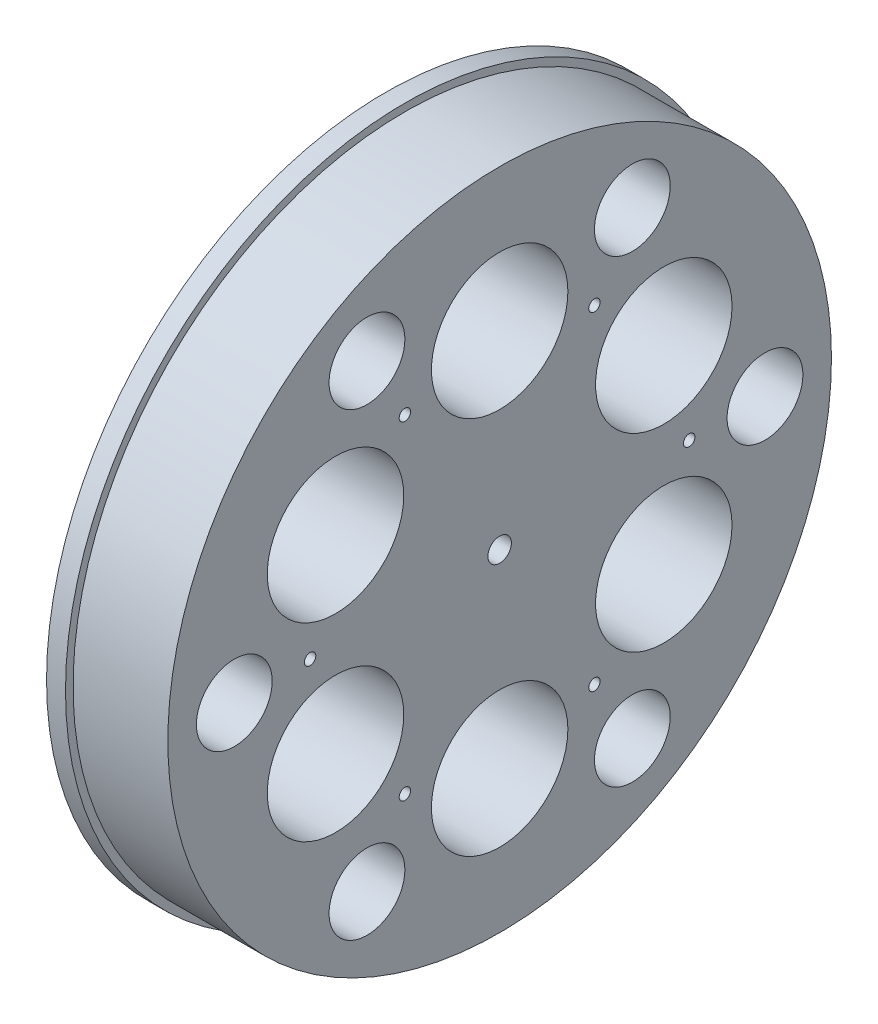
ISO-10303-21;
HEADER;
FILE_DESCRIPTION(('STEP AP214'),'2;1');
FILE_NAME('part.step','',(''),(''),'','','');
FILE_SCHEMA(('AUTOMOTIVE_DESIGN { 1 0 10303 214 1 1 1 1 }'));
ENDSEC;
DATA;
#1=APPLICATION_CONTEXT('core data for automotive mechanical design processes');
#2=APPLICATION_PROTOCOL_DEFINITION('international standard','automotive_design',2000,#1);
#3=PRODUCT_CONTEXT('',#1,'mechanical');
#4=PRODUCT('Part','Part','',(#3));
#5=PRODUCT_RELATED_PRODUCT_CATEGORY('part','',(#4));
#6=PRODUCT_DEFINITION_FORMATION('','',#4);
#7=PRODUCT_DEFINITION_CONTEXT('part definition',#1,'design');
#8=PRODUCT_DEFINITION('design','',#6,#7);
#9=PRODUCT_DEFINITION_SHAPE('','',#8);
#10=(LENGTH_UNIT() NAMED_UNIT(*) SI_UNIT(.MILLI.,.METRE.));
#11=(NAMED_UNIT(*) PLANE_ANGLE_UNIT() SI_UNIT($,.RADIAN.));
#12=(NAMED_UNIT(*) SI_UNIT($,.STERADIAN.) SOLID_ANGLE_UNIT());
#13=UNCERTAINTY_MEASURE_WITH_UNIT(LENGTH_MEASURE(1.E-05),#10,'distance_accuracy_value','');
#14=(GEOMETRIC_REPRESENTATION_CONTEXT(3) GLOBAL_UNCERTAINTY_ASSIGNED_CONTEXT((#13)) GLOBAL_UNIT_ASSIGNED_CONTEXT((#10,
#11,#12)) REPRESENTATION_CONTEXT('',''));
#15=CARTESIAN_POINT('',(0.,0.,0.));
#16=DIRECTION('',(0.,0.,1.));
#17=DIRECTION('',(1.,0.,0.));
#18=AXIS2_PLACEMENT_3D('',#15,#16,#17);
#19=CARTESIAN_POINT('',(30.,0.,-290.));
#20=DIRECTION('',(1.,0.,0.));
#21=DIRECTION('',(0.,0.,-1.));
#22=AXIS2_PLACEMENT_3D('',#19,#20,#21);
#23=PLANE('',#22);
#24=CARTESIAN_POINT('',(30.,0.,-290.));
#25=DIRECTION('',(1.,0.,0.));
#26=DIRECTION('',(0.,0.,-1.));
#27=AXIS2_PLACEMENT_3D('',#24,#25,#26);
#28=CIRCLE('',#27,3.09999999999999);
#29=CARTESIAN_POINT('',(30.,0.,-293.1));
#30=VERTEX_POINT('',#29);
#31=EDGE_CURVE('E152',#30,#30,#28,.T.);
#32=ORIENTED_EDGE('',*,*,#31,.F.);
#33=EDGE_LOOP('',(#32));
#34=FACE_BOUND('',#33,.T.);
#35=CARTESIAN_POINT('',(30.,-60.6217782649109,-324.999999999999));
#36=DIRECTION('',(1.,0.,0.));
#37=DIRECTION('',(0.,0.,-1.));
#38=AXIS2_PLACEMENT_3D('',#35,#36,#37);
#39=CIRCLE('',#38,10.);
#40=CARTESIAN_POINT('',(30.,-60.6217782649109,-334.999999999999));
#41=VERTEX_POINT('',#40);
#42=EDGE_CURVE('E140',#41,#41,#39,.T.);
#43=ORIENTED_EDGE('',*,*,#42,.F.);
#44=EDGE_LOOP('',(#43));
#45=FACE_BOUND('',#44,.T.);
#46=CARTESIAN_POINT('',(30.,60.6217782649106,-325.));
#47=DIRECTION('',(1.,0.,0.));
#48=DIRECTION('',(0.,0.,-1.));
#49=AXIS2_PLACEMENT_3D('',#46,#47,#48);
#50=CIRCLE('',#49,10.);
#51=CARTESIAN_POINT('',(30.,60.6217782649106,-335.));
#52=VERTEX_POINT('',#51);
#53=EDGE_CURVE('E128',#52,#52,#50,.T.);
#54=ORIENTED_EDGE('',*,*,#53,.F.);
#55=EDGE_LOOP('',(#54));
#56=FACE_BOUND('',#55,.T.);
#57=CARTESIAN_POINT('',(30.,-43.3012701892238,-264.999999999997));
#58=DIRECTION('',(1.,0.,0.));
#59=DIRECTION('',(0.,0.,-1.));
#60=AXIS2_PLACEMENT_3D('',#57,#58,#59);
#61=CIRCLE('',#60,1.50000000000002);
#62=CARTESIAN_POINT('',(30.,-43.3012701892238,-266.499999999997));
#63=VERTEX_POINT('',#62);
#64=EDGE_CURVE('E116',#63,#63,#61,.T.);
#65=ORIENTED_EDGE('',*,*,#64,.F.);
#66=EDGE_LOOP('',(#65));
#67=FACE_BOUND('',#66,.T.);
#68=CARTESIAN_POINT('',(30.,-43.3012701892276,-314.999999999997));
#69=DIRECTION('',(1.,0.,0.));
#70=DIRECTION('',(0.,0.,-1.));
#71=AXIS2_PLACEMENT_3D('',#68,#69,#70);
#72=CIRCLE('',#71,1.50000000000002);
#73=CARTESIAN_POINT('',(30.,-43.3012701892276,-316.499999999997));
#74=VERTEX_POINT('',#73);
#75=EDGE_CURVE('E104',#74,#74,#72,.T.);
#76=ORIENTED_EDGE('',*,*,#75,.F.);
#77=EDGE_LOOP('',(#76));
#78=FACE_BOUND('',#77,.T.);
#79=CARTESIAN_POINT('',(30.,-7.60502771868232E-12,-340.));
#80=DIRECTION('',(1.,0.,0.));
#81=DIRECTION('',(0.,0.,-1.));
#82=AXIS2_PLACEMENT_3D('',#79,#80,#81);
#83=CIRCLE('',#82,1.49999999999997);
#84=CARTESIAN_POINT('',(30.,-7.60502771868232E-12,-341.5));
#85=VERTEX_POINT('',#84);
#86=EDGE_CURVE('E92',#85,#85,#83,.T.);
#87=ORIENTED_EDGE('',*,*,#86,.F.);
#88=EDGE_LOOP('',(#87));
#89=FACE_BOUND('',#88,.T.);
#90=CARTESIAN_POINT('',(30.,0.,-220.));
#91=DIRECTION('',(1.,0.,0.));
#92=DIRECTION('',(0.,0.,-1.));
#93=AXIS2_PLACEMENT_3D('',#90,#91,#92);
#94=CIRCLE('',#93,10.);
#95=CARTESIAN_POINT('',(30.,0.,-230.));
#96=VERTEX_POINT('',#95);
#97=EDGE_CURVE('E80',#96,#96,#94,.T.);
#98=ORIENTED_EDGE('',*,*,#97,.F.);
#99=EDGE_LOOP('',(#98));
#100=FACE_BOUND('',#99,.T.);
#101=CARTESIAN_POINT('',(30.,-25.0000000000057,-333.301270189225));
#102=DIRECTION('',(1.,0.,0.));
#103=DIRECTION('',(0.,0.,-1.));
#104=AXIS2_PLACEMENT_3D('',#101,#102,#103);
#105=CIRCLE('',#104,18.);
#106=CARTESIAN_POINT('',(30.,-25.0000000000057,-351.301270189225));
#107=VERTEX_POINT('',#106);
#108=EDGE_CURVE('E68',#107,#107,#105,.T.);
#109=ORIENTED_EDGE('',*,*,#108,.F.);
#110=EDGE_LOOP('',(#109));
#111=FACE_BOUND('',#110,.T.);
#112=CARTESIAN_POINT('',(30.,24.9999999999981,-333.301270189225));
#113=DIRECTION('',(1.,0.,0.));
#114=DIRECTION('',(0.,0.,-1.));
#115=AXIS2_PLACEMENT_3D('',#112,#113,#114);
#116=CIRCLE('',#115,18.);
#117=CARTESIAN_POINT('',(30.,24.9999999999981,-351.301270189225));
#118=VERTEX_POINT('',#117);
#119=EDGE_CURVE('E56',#118,#118,#116,.T.);
#120=ORIENTED_EDGE('',*,*,#119,.F.);
#121=EDGE_LOOP('',(#120));
#122=FACE_BOUND('',#121,.T.);
#123=CARTESIAN_POINT('',(30.,50.,-290.));
#124=DIRECTION('',(1.,0.,0.));
#125=DIRECTION('',(0.,0.,-1.));
#126=AXIS2_PLACEMENT_3D('',#123,#124,#125);
#127=CIRCLE('',#126,18.);
#128=CARTESIAN_POINT('',(30.,50.,-308.));
#129=VERTEX_POINT('',#128);
#130=EDGE_CURVE('E43',#129,#129,#127,.T.);
#131=ORIENTED_EDGE('',*,*,#130,.F.);
#132=EDGE_LOOP('',(#131));
#133=FACE_BOUND('',#132,.T.);
#134=CARTESIAN_POINT('',(30.,0.,-240.));
#135=DIRECTION('',(1.,0.,0.));
#136=DIRECTION('',(0.,0.,-1.));
#137=AXIS2_PLACEMENT_3D('',#134,#135,#136);
#138=CIRCLE('',#137,1.5);
#139=CARTESIAN_POINT('',(30.,0.,-241.5));
#140=VERTEX_POINT('',#139);
#141=EDGE_CURVE('E51',#140,#140,#138,.T.);
#142=ORIENTED_EDGE('',*,*,#141,.F.);
#143=EDGE_LOOP('',(#142));
#144=FACE_BOUND('',#143,.T.);
#145=CARTESIAN_POINT('',(30.,43.30127018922,-265.000000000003));
#146=DIRECTION('',(1.,0.,0.));
#147=DIRECTION('',(0.,0.,-1.));
#148=AXIS2_PLACEMENT_3D('',#145,#146,#147);
#149=CIRCLE('',#148,1.50000000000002);
#150=CARTESIAN_POINT('',(30.,43.30127018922,-266.500000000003));
#151=VERTEX_POINT('',#150);
#152=EDGE_CURVE('E62',#151,#151,#149,.T.);
#153=ORIENTED_EDGE('',*,*,#152,.F.);
#154=EDGE_LOOP('',(#153));
#155=FACE_BOUND('',#154,.T.);
#156=CARTESIAN_POINT('',(30.,43.3012701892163,-315.000000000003));
#157=DIRECTION('',(1.,0.,0.));
#158=DIRECTION('',(0.,0.,-1.));
#159=AXIS2_PLACEMENT_3D('',#156,#157,#158);
#160=CIRCLE('',#159,1.50000000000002);
#161=CARTESIAN_POINT('',(30.,43.3012701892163,-316.500000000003));
#162=VERTEX_POINT('',#161);
#163=EDGE_CURVE('E74',#162,#162,#160,.T.);
#164=ORIENTED_EDGE('',*,*,#163,.F.);
#165=EDGE_LOOP('',(#164));
#166=FACE_BOUND('',#165,.T.);
#167=CARTESIAN_POINT('',(30.,-50.0000000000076,-290.));
#168=DIRECTION('',(1.,0.,0.));
#169=DIRECTION('',(0.,0.,-1.));
#170=AXIS2_PLACEMENT_3D('',#167,#168,#169);
#171=CIRCLE('',#170,18.);
#172=CARTESIAN_POINT('',(30.,-50.0000000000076,-308.));
#173=VERTEX_POINT('',#172);
#174=EDGE_CURVE('E86',#173,#173,#171,.T.);
#175=ORIENTED_EDGE('',*,*,#174,.F.);
#176=EDGE_LOOP('',(#175));
#177=FACE_BOUND('',#176,.T.);
#178=CARTESIAN_POINT('',(30.,-25.0000000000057,-246.698729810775));
#179=DIRECTION('',(1.,0.,0.));
#180=DIRECTION('',(0.,0.,-1.));
#181=AXIS2_PLACEMENT_3D('',#178,#179,#180);
#182=CIRCLE('',#181,18.);
#183=CARTESIAN_POINT('',(30.,-25.0000000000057,-264.698729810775));
#184=VERTEX_POINT('',#183);
#185=EDGE_CURVE('E98',#184,#184,#182,.T.);
#186=ORIENTED_EDGE('',*,*,#185,.F.);
#187=EDGE_LOOP('',(#186));
#188=FACE_BOUND('',#187,.T.);
#189=CARTESIAN_POINT('',(30.,24.9999999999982,-246.698729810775));
#190=DIRECTION('',(1.,0.,0.));
#191=DIRECTION('',(0.,0.,-1.));
#192=AXIS2_PLACEMENT_3D('',#189,#190,#191);
#193=CIRCLE('',#192,18.);
#194=CARTESIAN_POINT('',(30.,24.9999999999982,-264.698729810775));
#195=VERTEX_POINT('',#194);
#196=EDGE_CURVE('E110',#195,#195,#193,.T.);
#197=ORIENTED_EDGE('',*,*,#196,.F.);
#198=EDGE_LOOP('',(#197));
#199=FACE_BOUND('',#198,.T.);
#200=CARTESIAN_POINT('',(30.,60.6217782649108,-255.));
#201=DIRECTION('',(1.,0.,0.));
#202=DIRECTION('',(0.,0.,-1.));
#203=AXIS2_PLACEMENT_3D('',#200,#201,#202);
#204=CIRCLE('',#203,10.);
#205=CARTESIAN_POINT('',(30.,60.6217782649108,-265.));
#206=VERTEX_POINT('',#205);
#207=EDGE_CURVE('E122',#206,#206,#204,.T.);
#208=ORIENTED_EDGE('',*,*,#207,.F.);
#209=EDGE_LOOP('',(#208));
#210=FACE_BOUND('',#209,.T.);
#211=CARTESIAN_POINT('',(30.,-4.88807670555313E-13,-360.));
#212=DIRECTION('',(1.,0.,0.));
#213=DIRECTION('',(0.,0.,-1.));
#214=AXIS2_PLACEMENT_3D('',#211,#212,#213);
#215=CIRCLE('',#214,10.0000000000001);
#216=CARTESIAN_POINT('',(30.,-4.88807670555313E-13,-370.));
#217=VERTEX_POINT('',#216);
#218=EDGE_CURVE('E134',#217,#217,#215,.T.);
#219=ORIENTED_EDGE('',*,*,#218,.F.);
#220=EDGE_LOOP('',(#219));
#221=FACE_BOUND('',#220,.T.);
#222=CARTESIAN_POINT('',(30.,-60.6217782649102,-254.999999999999));
#223=DIRECTION('',(1.,0.,0.));
#224=DIRECTION('',(0.,0.,-1.));
#225=AXIS2_PLACEMENT_3D('',#222,#223,#224);
#226=CIRCLE('',#225,9.99999999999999);
#227=CARTESIAN_POINT('',(30.,-60.6217782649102,-264.999999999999));
#228=VERTEX_POINT('',#227);
#229=EDGE_CURVE('E146',#228,#228,#226,.T.);
#230=ORIENTED_EDGE('',*,*,#229,.F.);
#231=EDGE_LOOP('',(#230));
#232=FACE_BOUND('',#231,.T.);
#233=CARTESIAN_POINT('',(30.,0.,-290.));
#234=DIRECTION('',(1.,0.,0.));
#235=DIRECTION('',(0.,0.,-1.));
#236=AXIS2_PLACEMENT_3D('',#233,#234,#235);
#237=CIRCLE('',#236,87.535);
#238=CARTESIAN_POINT('',(30.,0.,-377.535));
#239=VERTEX_POINT('',#238);
#240=EDGE_CURVE('E160',#239,#239,#237,.T.);
#241=ORIENTED_EDGE('',*,*,#240,.T.);
#242=EDGE_LOOP('',(#241));
#243=FACE_BOUND('',#242,.T.);
#244=ADVANCED_FACE('F35',(#34,#45,#56,#67,#78,#89,#100,#111,#122,#133,#144,#155,#166,#177,#188,
#199,#210,#221,#232,#243),#23,.T.);
#245=CARTESIAN_POINT('',(30.,0.,-290.));
#246=DIRECTION('',(-1.,0.,0.));
#247=DIRECTION('',(0.,0.,1.));
#248=AXIS2_PLACEMENT_3D('',#245,#246,#247);
#249=CYLINDRICAL_SURFACE('',#248,89.535);
#250=CARTESIAN_POINT('',(0.,0.,-290.));
#251=DIRECTION('',(1.,0.,0.));
#252=DIRECTION('',(0.,0.,-1.));
#253=AXIS2_PLACEMENT_3D('',#250,#251,#252);
#254=CIRCLE('',#253,89.535);
#255=CARTESIAN_POINT('',(0.,0.,-379.535));
#256=VERTEX_POINT('',#255);
#257=EDGE_CURVE('E10',#256,#256,#254,.T.);
#258=ORIENTED_EDGE('',*,*,#257,.T.);
#259=EDGE_LOOP('',(#258));
#260=FACE_BOUND('',#259,.T.);
#261=CARTESIAN_POINT('',(5.,0.,-290.));
#262=DIRECTION('',(1.,0.,0.));
#263=DIRECTION('',(0.,0.,-1.));
#264=AXIS2_PLACEMENT_3D('',#261,#262,#263);
#265=CIRCLE('',#264,89.535);
#266=CARTESIAN_POINT('',(5.,0.,-379.535));
#267=VERTEX_POINT('',#266);
#268=EDGE_CURVE('E39',#267,#267,#265,.T.);
#269=ORIENTED_EDGE('',*,*,#268,.F.);
#270=EDGE_LOOP('',(#269));
#271=FACE_BOUND('',#270,.T.);
#272=ADVANCED_FACE('F37',(#260,#271),#249,.T.);
#273=CARTESIAN_POINT('',(0.,0.,-290.));
#274=DIRECTION('',(1.,0.,0.));
#275=DIRECTION('',(0.,0.,-1.));
#276=AXIS2_PLACEMENT_3D('',#273,#274,#275);
#277=PLANE('',#276);
#278=CARTESIAN_POINT('',(0.,-60.6217782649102,-254.999999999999));
#279=DIRECTION('',(1.,0.,0.));
#280=DIRECTION('',(0.,0.,-1.));
#281=AXIS2_PLACEMENT_3D('',#278,#279,#280);
#282=CIRCLE('',#281,9.99999999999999);
#283=CARTESIAN_POINT('',(0.,-60.6217782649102,-264.999999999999));
#284=VERTEX_POINT('',#283);
#285=EDGE_CURVE('E149',#284,#284,#282,.T.);
#286=ORIENTED_EDGE('',*,*,#285,.T.);
#287=EDGE_LOOP('',(#286));
#288=FACE_BOUND('',#287,.T.);
#289=CARTESIAN_POINT('',(0.,-4.88807670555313E-13,-360.));
#290=DIRECTION('',(1.,0.,0.));
#291=DIRECTION('',(0.,0.,-1.));
#292=AXIS2_PLACEMENT_3D('',#289,#290,#291);
#293=CIRCLE('',#292,10.0000000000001);
#294=CARTESIAN_POINT('',(0.,-4.88807670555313E-13,-370.));
#295=VERTEX_POINT('',#294);
#296=EDGE_CURVE('E137',#295,#295,#293,.T.);
#297=ORIENTED_EDGE('',*,*,#296,.T.);
#298=EDGE_LOOP('',(#297));
#299=FACE_BOUND('',#298,.T.);
#300=CARTESIAN_POINT('',(0.,60.6217782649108,-255.));
#301=DIRECTION('',(1.,0.,0.));
#302=DIRECTION('',(0.,0.,-1.));
#303=AXIS2_PLACEMENT_3D('',#300,#301,#302);
#304=CIRCLE('',#303,10.);
#305=CARTESIAN_POINT('',(0.,60.6217782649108,-265.));
#306=VERTEX_POINT('',#305);
#307=EDGE_CURVE('E125',#306,#306,#304,.T.);
#308=ORIENTED_EDGE('',*,*,#307,.T.);
#309=EDGE_LOOP('',(#308));
#310=FACE_BOUND('',#309,.T.);
#311=CARTESIAN_POINT('',(0.,24.9999999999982,-246.698729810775));
#312=DIRECTION('',(1.,0.,0.));
#313=DIRECTION('',(0.,0.,-1.));
#314=AXIS2_PLACEMENT_3D('',#311,#312,#313);
#315=CIRCLE('',#314,18.);
#316=CARTESIAN_POINT('',(0.,24.9999999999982,-264.698729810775));
#317=VERTEX_POINT('',#316);
#318=EDGE_CURVE('E113',#317,#317,#315,.T.);
#319=ORIENTED_EDGE('',*,*,#318,.T.);
#320=EDGE_LOOP('',(#319));
#321=FACE_BOUND('',#320,.T.);
#322=CARTESIAN_POINT('',(0.,-25.0000000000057,-246.698729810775));
#323=DIRECTION('',(1.,0.,0.));
#324=DIRECTION('',(0.,0.,-1.));
#325=AXIS2_PLACEMENT_3D('',#322,#323,#324);
#326=CIRCLE('',#325,18.);
#327=CARTESIAN_POINT('',(0.,-25.0000000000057,-264.698729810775));
#328=VERTEX_POINT('',#327);
#329=EDGE_CURVE('E101',#328,#328,#326,.T.);
#330=ORIENTED_EDGE('',*,*,#329,.T.);
#331=EDGE_LOOP('',(#330));
#332=FACE_BOUND('',#331,.T.);
#333=CARTESIAN_POINT('',(0.,-50.0000000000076,-290.));
#334=DIRECTION('',(1.,0.,0.));
#335=DIRECTION('',(0.,0.,-1.));
#336=AXIS2_PLACEMENT_3D('',#333,#334,#335);
#337=CIRCLE('',#336,18.);
#338=CARTESIAN_POINT('',(0.,-50.0000000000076,-308.));
#339=VERTEX_POINT('',#338);
#340=EDGE_CURVE('E89',#339,#339,#337,.T.);
#341=ORIENTED_EDGE('',*,*,#340,.T.);
#342=EDGE_LOOP('',(#341));
#343=FACE_BOUND('',#342,.T.);
#344=CARTESIAN_POINT('',(0.,43.3012701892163,-315.000000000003));
#345=DIRECTION('',(1.,0.,0.));
#346=DIRECTION('',(0.,0.,-1.));
#347=AXIS2_PLACEMENT_3D('',#344,#345,#346);
#348=CIRCLE('',#347,1.50000000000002);
#349=CARTESIAN_POINT('',(0.,43.3012701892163,-316.500000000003));
#350=VERTEX_POINT('',#349);
#351=EDGE_CURVE('E77',#350,#350,#348,.T.);
#352=ORIENTED_EDGE('',*,*,#351,.T.);
#353=EDGE_LOOP('',(#352));
#354=FACE_BOUND('',#353,.T.);
#355=CARTESIAN_POINT('',(0.,43.30127018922,-265.000000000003));
#356=DIRECTION('',(1.,0.,0.));
#357=DIRECTION('',(0.,0.,-1.));
#358=AXIS2_PLACEMENT_3D('',#355,#356,#357);
#359=CIRCLE('',#358,1.50000000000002);
#360=CARTESIAN_POINT('',(0.,43.30127018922,-266.500000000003));
#361=VERTEX_POINT('',#360);
#362=EDGE_CURVE('E65',#361,#361,#359,.T.);
#363=ORIENTED_EDGE('',*,*,#362,.T.);
#364=EDGE_LOOP('',(#363));
#365=FACE_BOUND('',#364,.T.);
#366=CARTESIAN_POINT('',(0.,0.,-240.));
#367=DIRECTION('',(1.,0.,0.));
#368=DIRECTION('',(0.,0.,-1.));
#369=AXIS2_PLACEMENT_3D('',#366,#367,#368);
#370=CIRCLE('',#369,1.5);
#371=CARTESIAN_POINT('',(0.,0.,-241.5));
#372=VERTEX_POINT('',#371);
#373=EDGE_CURVE('E53',#372,#372,#370,.T.);
#374=ORIENTED_EDGE('',*,*,#373,.T.);
#375=EDGE_LOOP('',(#374));
#376=FACE_BOUND('',#375,.T.);
#377=ORIENTED_EDGE('',*,*,#257,.F.);
#378=EDGE_LOOP('',(#377));
#379=FACE_BOUND('',#378,.T.);
#380=CARTESIAN_POINT('',(0.,50.,-290.));
#381=DIRECTION('',(1.,0.,0.));
#382=DIRECTION('',(0.,0.,-1.));
#383=AXIS2_PLACEMENT_3D('',#380,#381,#382);
#384=CIRCLE('',#383,18.);
#385=CARTESIAN_POINT('',(0.,50.,-308.));
#386=VERTEX_POINT('',#385);
#387=EDGE_CURVE('E47',#386,#386,#384,.T.);
#388=ORIENTED_EDGE('',*,*,#387,.T.);
#389=EDGE_LOOP('',(#388));
#390=FACE_BOUND('',#389,.T.);
#391=CARTESIAN_POINT('',(0.,24.9999999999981,-333.301270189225));
#392=DIRECTION('',(1.,0.,0.));
#393=DIRECTION('',(0.,0.,-1.));
#394=AXIS2_PLACEMENT_3D('',#391,#392,#393);
#395=CIRCLE('',#394,18.);
#396=CARTESIAN_POINT('',(0.,24.9999999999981,-351.301270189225));
#397=VERTEX_POINT('',#396);
#398=EDGE_CURVE('E59',#397,#397,#395,.T.);
#399=ORIENTED_EDGE('',*,*,#398,.T.);
#400=EDGE_LOOP('',(#399));
#401=FACE_BOUND('',#400,.T.);
#402=CARTESIAN_POINT('',(0.,-25.0000000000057,-333.301270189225));
#403=DIRECTION('',(1.,0.,0.));
#404=DIRECTION('',(0.,0.,-1.));
#405=AXIS2_PLACEMENT_3D('',#402,#403,#404);
#406=CIRCLE('',#405,18.);
#407=CARTESIAN_POINT('',(0.,-25.0000000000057,-351.301270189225));
#408=VERTEX_POINT('',#407);
#409=EDGE_CURVE('E71',#408,#408,#406,.T.);
#410=ORIENTED_EDGE('',*,*,#409,.T.);
#411=EDGE_LOOP('',(#410));
#412=FACE_BOUND('',#411,.T.);
#413=CARTESIAN_POINT('',(0.,0.,-220.));
#414=DIRECTION('',(1.,0.,0.));
#415=DIRECTION('',(0.,0.,-1.));
#416=AXIS2_PLACEMENT_3D('',#413,#414,#415);
#417=CIRCLE('',#416,10.);
#418=CARTESIAN_POINT('',(0.,0.,-230.));
#419=VERTEX_POINT('',#418);
#420=EDGE_CURVE('E83',#419,#419,#417,.T.);
#421=ORIENTED_EDGE('',*,*,#420,.T.);
#422=EDGE_LOOP('',(#421));
#423=FACE_BOUND('',#422,.T.);
#424=CARTESIAN_POINT('',(0.,-7.60502771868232E-12,-340.));
#425=DIRECTION('',(1.,0.,0.));
#426=DIRECTION('',(0.,0.,-1.));
#427=AXIS2_PLACEMENT_3D('',#424,#425,#426);
#428=CIRCLE('',#427,1.49999999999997);
#429=CARTESIAN_POINT('',(0.,-7.60502771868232E-12,-341.5));
#430=VERTEX_POINT('',#429);
#431=EDGE_CURVE('E95',#430,#430,#428,.T.);
#432=ORIENTED_EDGE('',*,*,#431,.T.);
#433=EDGE_LOOP('',(#432));
#434=FACE_BOUND('',#433,.T.);
#435=CARTESIAN_POINT('',(0.,-43.3012701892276,-314.999999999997));
#436=DIRECTION('',(1.,0.,0.));
#437=DIRECTION('',(0.,0.,-1.));
#438=AXIS2_PLACEMENT_3D('',#435,#436,#437);
#439=CIRCLE('',#438,1.50000000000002);
#440=CARTESIAN_POINT('',(0.,-43.3012701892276,-316.499999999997));
#441=VERTEX_POINT('',#440);
#442=EDGE_CURVE('E107',#441,#441,#439,.T.);
#443=ORIENTED_EDGE('',*,*,#442,.T.);
#444=EDGE_LOOP('',(#443));
#445=FACE_BOUND('',#444,.T.);
#446=CARTESIAN_POINT('',(0.,-43.3012701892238,-264.999999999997));
#447=DIRECTION('',(1.,0.,0.));
#448=DIRECTION('',(0.,0.,-1.));
#449=AXIS2_PLACEMENT_3D('',#446,#447,#448);
#450=CIRCLE('',#449,1.50000000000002);
#451=CARTESIAN_POINT('',(0.,-43.3012701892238,-266.499999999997));
#452=VERTEX_POINT('',#451);
#453=EDGE_CURVE('E119',#452,#452,#450,.T.);
#454=ORIENTED_EDGE('',*,*,#453,.T.);
#455=EDGE_LOOP('',(#454));
#456=FACE_BOUND('',#455,.T.);
#457=CARTESIAN_POINT('',(0.,60.6217782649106,-325.));
#458=DIRECTION('',(1.,0.,0.));
#459=DIRECTION('',(0.,0.,-1.));
#460=AXIS2_PLACEMENT_3D('',#457,#458,#459);
#461=CIRCLE('',#460,10.);
#462=CARTESIAN_POINT('',(0.,60.6217782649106,-335.));
#463=VERTEX_POINT('',#462);
#464=EDGE_CURVE('E131',#463,#463,#461,.T.);
#465=ORIENTED_EDGE('',*,*,#464,.T.);
#466=EDGE_LOOP('',(#465));
#467=FACE_BOUND('',#466,.T.);
#468=CARTESIAN_POINT('',(0.,-60.6217782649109,-324.999999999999));
#469=DIRECTION('',(1.,0.,0.));
#470=DIRECTION('',(0.,0.,-1.));
#471=AXIS2_PLACEMENT_3D('',#468,#469,#470);
#472=CIRCLE('',#471,10.);
#473=CARTESIAN_POINT('',(0.,-60.6217782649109,-334.999999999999));
#474=VERTEX_POINT('',#473);
#475=EDGE_CURVE('E143',#474,#474,#472,.T.);
#476=ORIENTED_EDGE('',*,*,#475,.T.);
#477=EDGE_LOOP('',(#476));
#478=FACE_BOUND('',#477,.T.);
#479=CARTESIAN_POINT('',(0.,0.,-290.));
#480=DIRECTION('',(1.,0.,0.));
#481=DIRECTION('',(0.,0.,-1.));
#482=AXIS2_PLACEMENT_3D('',#479,#480,#481);
#483=CIRCLE('',#482,3.09999999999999);
#484=CARTESIAN_POINT('',(0.,0.,-293.1));
#485=VERTEX_POINT('',#484);
#486=EDGE_CURVE('E155',#485,#485,#483,.T.);
#487=ORIENTED_EDGE('',*,*,#486,.T.);
#488=EDGE_LOOP('',(#487));
#489=FACE_BOUND('',#488,.T.);
#490=ADVANCED_FACE('F173',(#288,#299,#310,#321,#332,#343,#354,#365,#376,#379,#390,#401,#412,
#423,#434,#445,#456,#467,#478,#489),#277,.F.);
#491=CARTESIAN_POINT('',(30.,50.,-290.));
#492=DIRECTION('',(-1.,0.,0.));
#493=DIRECTION('',(0.,0.,1.));
#494=AXIS2_PLACEMENT_3D('',#491,#492,#493);
#495=CYLINDRICAL_SURFACE('',#494,18.);
#496=ORIENTED_EDGE('',*,*,#130,.T.);
#497=EDGE_LOOP('',(#496));
#498=FACE_BOUND('',#497,.T.);
#499=ORIENTED_EDGE('',*,*,#387,.F.);
#500=EDGE_LOOP('',(#499));
#501=FACE_BOUND('',#500,.T.);
#502=ADVANCED_FACE('F178',(#498,#501),#495,.F.);
#503=CARTESIAN_POINT('',(30.,0.,-240.));
#504=DIRECTION('',(-1.,0.,0.));
#505=DIRECTION('',(0.,0.,1.));
#506=AXIS2_PLACEMENT_3D('',#503,#504,#505);
#507=CYLINDRICAL_SURFACE('',#506,1.5);
#508=ORIENTED_EDGE('',*,*,#141,.T.);
#509=EDGE_LOOP('',(#508));
#510=FACE_BOUND('',#509,.T.);
#511=ORIENTED_EDGE('',*,*,#373,.F.);
#512=EDGE_LOOP('',(#511));
#513=FACE_BOUND('',#512,.T.);
#514=ADVANCED_FACE('F189',(#510,#513),#507,.F.);
#515=CARTESIAN_POINT('',(30.,24.9999999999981,-333.301270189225));
#516=DIRECTION('',(-1.,0.,0.));
#517=DIRECTION('',(0.,0.,1.));
#518=AXIS2_PLACEMENT_3D('',#515,#516,#517);
#519=CYLINDRICAL_SURFACE('',#518,18.);
#520=ORIENTED_EDGE('',*,*,#119,.T.);
#521=EDGE_LOOP('',(#520));
#522=FACE_BOUND('',#521,.T.);
#523=ORIENTED_EDGE('',*,*,#398,.F.);
#524=EDGE_LOOP('',(#523));
#525=FACE_BOUND('',#524,.T.);
#526=ADVANCED_FACE('F193',(#522,#525),#519,.F.);
#527=CARTESIAN_POINT('',(30.,43.30127018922,-265.000000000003));
#528=DIRECTION('',(-1.,0.,0.));
#529=DIRECTION('',(0.,0.,1.));
#530=AXIS2_PLACEMENT_3D('',#527,#528,#529);
#531=CYLINDRICAL_SURFACE('',#530,1.50000000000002);
#532=ORIENTED_EDGE('',*,*,#152,.T.);
#533=EDGE_LOOP('',(#532));
#534=FACE_BOUND('',#533,.T.);
#535=ORIENTED_EDGE('',*,*,#362,.F.);
#536=EDGE_LOOP('',(#535));
#537=FACE_BOUND('',#536,.T.);
#538=ADVANCED_FACE('F197',(#534,#537),#531,.F.);
#539=CARTESIAN_POINT('',(30.,-25.0000000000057,-333.301270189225));
#540=DIRECTION('',(-1.,0.,0.));
#541=DIRECTION('',(0.,0.,1.));
#542=AXIS2_PLACEMENT_3D('',#539,#540,#541);
#543=CYLINDRICAL_SURFACE('',#542,18.);
#544=ORIENTED_EDGE('',*,*,#108,.T.);
#545=EDGE_LOOP('',(#544));
#546=FACE_BOUND('',#545,.T.);
#547=ORIENTED_EDGE('',*,*,#409,.F.);
#548=EDGE_LOOP('',(#547));
#549=FACE_BOUND('',#548,.T.);
#550=ADVANCED_FACE('F201',(#546,#549),#543,.F.);
#551=CARTESIAN_POINT('',(30.,43.3012701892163,-315.000000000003));
#552=DIRECTION('',(-1.,0.,0.));
#553=DIRECTION('',(0.,0.,1.));
#554=AXIS2_PLACEMENT_3D('',#551,#552,#553);
#555=CYLINDRICAL_SURFACE('',#554,1.50000000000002);
#556=ORIENTED_EDGE('',*,*,#163,.T.);
#557=EDGE_LOOP('',(#556));
#558=FACE_BOUND('',#557,.T.);
#559=ORIENTED_EDGE('',*,*,#351,.F.);
#560=EDGE_LOOP('',(#559));
#561=FACE_BOUND('',#560,.T.);
#562=ADVANCED_FACE('F205',(#558,#561),#555,.F.);
#563=CARTESIAN_POINT('',(30.,0.,-220.));
#564=DIRECTION('',(-1.,0.,0.));
#565=DIRECTION('',(0.,0.,1.));
#566=AXIS2_PLACEMENT_3D('',#563,#564,#565);
#567=CYLINDRICAL_SURFACE('',#566,10.);
#568=ORIENTED_EDGE('',*,*,#97,.T.);
#569=EDGE_LOOP('',(#568));
#570=FACE_BOUND('',#569,.T.);
#571=ORIENTED_EDGE('',*,*,#420,.F.);
#572=EDGE_LOOP('',(#571));
#573=FACE_BOUND('',#572,.T.);
#574=ADVANCED_FACE('F209',(#570,#573),#567,.F.);
#575=CARTESIAN_POINT('',(30.,-50.0000000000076,-290.));
#576=DIRECTION('',(-1.,0.,0.));
#577=DIRECTION('',(0.,0.,1.));
#578=AXIS2_PLACEMENT_3D('',#575,#576,#577);
#579=CYLINDRICAL_SURFACE('',#578,18.);
#580=ORIENTED_EDGE('',*,*,#174,.T.);
#581=EDGE_LOOP('',(#580));
#582=FACE_BOUND('',#581,.T.);
#583=ORIENTED_EDGE('',*,*,#340,.F.);
#584=EDGE_LOOP('',(#583));
#585=FACE_BOUND('',#584,.T.);
#586=ADVANCED_FACE('F213',(#582,#585),#579,.F.);
#587=CARTESIAN_POINT('',(30.,-7.60502771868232E-12,-340.));
#588=DIRECTION('',(-1.,0.,0.));
#589=DIRECTION('',(0.,0.,1.));
#590=AXIS2_PLACEMENT_3D('',#587,#588,#589);
#591=CYLINDRICAL_SURFACE('',#590,1.49999999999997);
#592=ORIENTED_EDGE('',*,*,#86,.T.);
#593=EDGE_LOOP('',(#592));
#594=FACE_BOUND('',#593,.T.);
#595=ORIENTED_EDGE('',*,*,#431,.F.);
#596=EDGE_LOOP('',(#595));
#597=FACE_BOUND('',#596,.T.);
#598=ADVANCED_FACE('F217',(#594,#597),#591,.F.);
#599=CARTESIAN_POINT('',(30.,-25.0000000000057,-246.698729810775));
#600=DIRECTION('',(-1.,0.,0.));
#601=DIRECTION('',(0.,0.,1.));
#602=AXIS2_PLACEMENT_3D('',#599,#600,#601);
#603=CYLINDRICAL_SURFACE('',#602,18.);
#604=ORIENTED_EDGE('',*,*,#185,.T.);
#605=EDGE_LOOP('',(#604));
#606=FACE_BOUND('',#605,.T.);
#607=ORIENTED_EDGE('',*,*,#329,.F.);
#608=EDGE_LOOP('',(#607));
#609=FACE_BOUND('',#608,.T.);
#610=ADVANCED_FACE('F221',(#606,#609),#603,.F.);
#611=CARTESIAN_POINT('',(30.,-43.3012701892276,-314.999999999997));
#612=DIRECTION('',(-1.,0.,0.));
#613=DIRECTION('',(0.,0.,1.));
#614=AXIS2_PLACEMENT_3D('',#611,#612,#613);
#615=CYLINDRICAL_SURFACE('',#614,1.50000000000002);
#616=ORIENTED_EDGE('',*,*,#75,.T.);
#617=EDGE_LOOP('',(#616));
#618=FACE_BOUND('',#617,.T.);
#619=ORIENTED_EDGE('',*,*,#442,.F.);
#620=EDGE_LOOP('',(#619));
#621=FACE_BOUND('',#620,.T.);
#622=ADVANCED_FACE('F225',(#618,#621),#615,.F.);
#623=CARTESIAN_POINT('',(30.,24.9999999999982,-246.698729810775));
#624=DIRECTION('',(-1.,0.,0.));
#625=DIRECTION('',(0.,0.,1.));
#626=AXIS2_PLACEMENT_3D('',#623,#624,#625);
#627=CYLINDRICAL_SURFACE('',#626,18.);
#628=ORIENTED_EDGE('',*,*,#196,.T.);
#629=EDGE_LOOP('',(#628));
#630=FACE_BOUND('',#629,.T.);
#631=ORIENTED_EDGE('',*,*,#318,.F.);
#632=EDGE_LOOP('',(#631));
#633=FACE_BOUND('',#632,.T.);
#634=ADVANCED_FACE('F229',(#630,#633),#627,.F.);
#635=CARTESIAN_POINT('',(30.,-43.3012701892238,-264.999999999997));
#636=DIRECTION('',(-1.,0.,0.));
#637=DIRECTION('',(0.,0.,1.));
#638=AXIS2_PLACEMENT_3D('',#635,#636,#637);
#639=CYLINDRICAL_SURFACE('',#638,1.50000000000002);
#640=ORIENTED_EDGE('',*,*,#64,.T.);
#641=EDGE_LOOP('',(#640));
#642=FACE_BOUND('',#641,.T.);
#643=ORIENTED_EDGE('',*,*,#453,.F.);
#644=EDGE_LOOP('',(#643));
#645=FACE_BOUND('',#644,.T.);
#646=ADVANCED_FACE('F233',(#642,#645),#639,.F.);
#647=CARTESIAN_POINT('',(30.,60.6217782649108,-255.));
#648=DIRECTION('',(-1.,0.,0.));
#649=DIRECTION('',(0.,0.,1.));
#650=AXIS2_PLACEMENT_3D('',#647,#648,#649);
#651=CYLINDRICAL_SURFACE('',#650,10.);
#652=ORIENTED_EDGE('',*,*,#207,.T.);
#653=EDGE_LOOP('',(#652));
#654=FACE_BOUND('',#653,.T.);
#655=ORIENTED_EDGE('',*,*,#307,.F.);
#656=EDGE_LOOP('',(#655));
#657=FACE_BOUND('',#656,.T.);
#658=ADVANCED_FACE('F237',(#654,#657),#651,.F.);
#659=CARTESIAN_POINT('',(30.,60.6217782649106,-325.));
#660=DIRECTION('',(-1.,0.,0.));
#661=DIRECTION('',(0.,0.,1.));
#662=AXIS2_PLACEMENT_3D('',#659,#660,#661);
#663=CYLINDRICAL_SURFACE('',#662,10.);
#664=ORIENTED_EDGE('',*,*,#53,.T.);
#665=EDGE_LOOP('',(#664));
#666=FACE_BOUND('',#665,.T.);
#667=ORIENTED_EDGE('',*,*,#464,.F.);
#668=EDGE_LOOP('',(#667));
#669=FACE_BOUND('',#668,.T.);
#670=ADVANCED_FACE('F241',(#666,#669),#663,.F.);
#671=CARTESIAN_POINT('',(30.,-4.88807670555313E-13,-360.));
#672=DIRECTION('',(-1.,0.,0.));
#673=DIRECTION('',(0.,0.,1.));
#674=AXIS2_PLACEMENT_3D('',#671,#672,#673);
#675=CYLINDRICAL_SURFACE('',#674,10.0000000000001);
#676=ORIENTED_EDGE('',*,*,#218,.T.);
#677=EDGE_LOOP('',(#676));
#678=FACE_BOUND('',#677,.T.);
#679=ORIENTED_EDGE('',*,*,#296,.F.);
#680=EDGE_LOOP('',(#679));
#681=FACE_BOUND('',#680,.T.);
#682=ADVANCED_FACE('F245',(#678,#681),#675,.F.);
#683=CARTESIAN_POINT('',(30.,-60.6217782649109,-324.999999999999));
#684=DIRECTION('',(-1.,0.,0.));
#685=DIRECTION('',(0.,0.,1.));
#686=AXIS2_PLACEMENT_3D('',#683,#684,#685);
#687=CYLINDRICAL_SURFACE('',#686,10.);
#688=ORIENTED_EDGE('',*,*,#42,.T.);
#689=EDGE_LOOP('',(#688));
#690=FACE_BOUND('',#689,.T.);
#691=ORIENTED_EDGE('',*,*,#475,.F.);
#692=EDGE_LOOP('',(#691));
#693=FACE_BOUND('',#692,.T.);
#694=ADVANCED_FACE('F249',(#690,#693),#687,.F.);
#695=CARTESIAN_POINT('',(30.,-60.6217782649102,-254.999999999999));
#696=DIRECTION('',(-1.,0.,0.));
#697=DIRECTION('',(0.,0.,1.));
#698=AXIS2_PLACEMENT_3D('',#695,#696,#697);
#699=CYLINDRICAL_SURFACE('',#698,9.99999999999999);
#700=ORIENTED_EDGE('',*,*,#229,.T.);
#701=EDGE_LOOP('',(#700));
#702=FACE_BOUND('',#701,.T.);
#703=ORIENTED_EDGE('',*,*,#285,.F.);
#704=EDGE_LOOP('',(#703));
#705=FACE_BOUND('',#704,.T.);
#706=ADVANCED_FACE('F253',(#702,#705),#699,.F.);
#707=CARTESIAN_POINT('',(30.,0.,-290.));
#708=DIRECTION('',(-1.,0.,0.));
#709=DIRECTION('',(0.,0.,1.));
#710=AXIS2_PLACEMENT_3D('',#707,#708,#709);
#711=CYLINDRICAL_SURFACE('',#710,3.09999999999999);
#712=ORIENTED_EDGE('',*,*,#31,.T.);
#713=EDGE_LOOP('',(#712));
#714=FACE_BOUND('',#713,.T.);
#715=ORIENTED_EDGE('',*,*,#486,.F.);
#716=EDGE_LOOP('',(#715));
#717=FACE_BOUND('',#716,.T.);
#718=ADVANCED_FACE('F257',(#714,#717),#711,.F.);
#719=CARTESIAN_POINT('',(5.,0.,-290.));
#720=DIRECTION('',(1.,0.,0.));
#721=DIRECTION('',(0.,0.,-1.));
#722=AXIS2_PLACEMENT_3D('',#719,#720,#721);
#723=PLANE('',#722);
#724=CARTESIAN_POINT('',(5.,0.,-290.));
#725=DIRECTION('',(1.,0.,0.));
#726=DIRECTION('',(0.,0.,-1.));
#727=AXIS2_PLACEMENT_3D('',#724,#725,#726);
#728=CIRCLE('',#727,87.535);
#729=CARTESIAN_POINT('',(5.,0.,-377.535));
#730=VERTEX_POINT('',#729);
#731=EDGE_CURVE('E163',#730,#730,#728,.T.);
#732=ORIENTED_EDGE('',*,*,#731,.F.);
#733=EDGE_LOOP('',(#732));
#734=FACE_BOUND('',#733,.T.);
#735=ORIENTED_EDGE('',*,*,#268,.T.);
#736=EDGE_LOOP('',(#735));
#737=FACE_BOUND('',#736,.T.);
#738=ADVANCED_FACE('F170',(#734,#737),#723,.T.);
#739=CARTESIAN_POINT('',(5.,0.,-290.));
#740=DIRECTION('',(1.,0.,0.));
#741=DIRECTION('',(0.,0.,-1.));
#742=AXIS2_PLACEMENT_3D('',#739,#740,#741);
#743=CYLINDRICAL_SURFACE('',#742,87.535);
#744=ORIENTED_EDGE('',*,*,#731,.T.);
#745=EDGE_LOOP('',(#744));
#746=FACE_BOUND('',#745,.T.);
#747=ORIENTED_EDGE('',*,*,#240,.F.);
#748=EDGE_LOOP('',(#747));
#749=FACE_BOUND('',#748,.T.);
#750=ADVANCED_FACE('F264',(#746,#749),#743,.T.);
#751=CLOSED_SHELL('',(#244,#272,#490,#502,#514,#526,#538,#550,#562,#574,#586,#598,#610,#622,
#634,#646,#658,#670,#682,#694,#706,#718,#738,#750));
#752=MANIFOLD_SOLID_BREP('B2',#751);
#753=ADVANCED_BREP_SHAPE_REPRESENTATION('',(#18,#752),#14);
#754=SHAPE_DEFINITION_REPRESENTATION(#9,#753);
ENDSEC;
END-ISO-10303-21;
